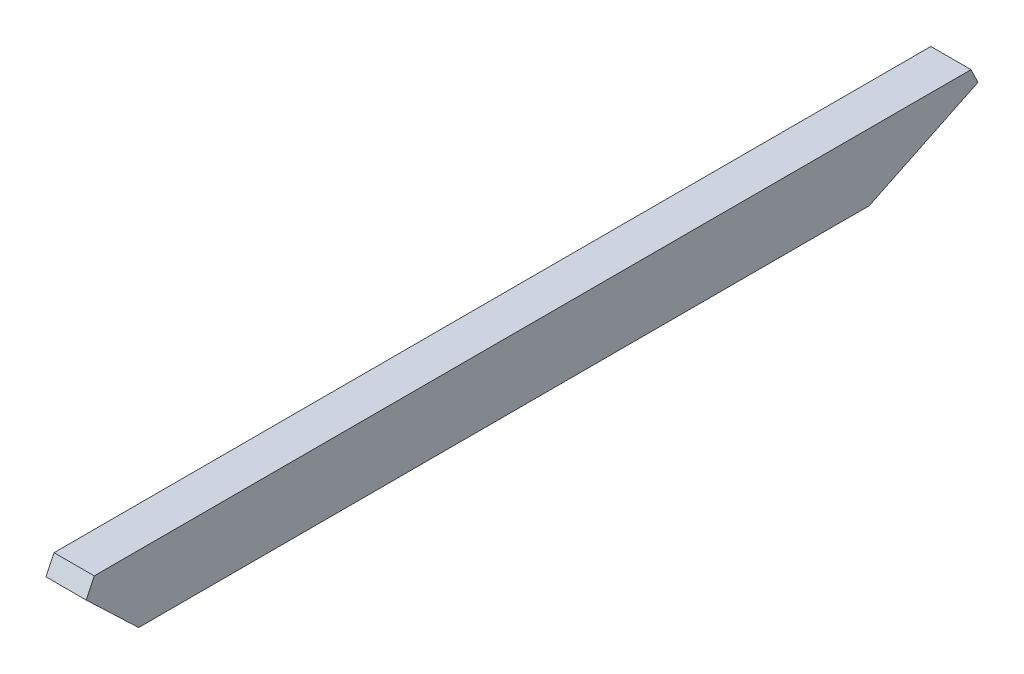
from build123d import *

# Parameters (mm, degrees)
ESQUISSE1_W             = 15
ESQUISSE1_H             = 25
EXTRUSION1_DEPTH        = 333
ENL_V_MAT_EXTRU_1_DEPTH = 335.273839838
ENL_V_MAT_EXTRU_2_DEPTH = 335.273839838
ENL_V_MAT_EXTRU_3_DEPTH = 335.273839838


with BuildPart() as part:
    # Esquisse1 → Extrusion1 (new body)
    with BuildSketch(Plane.XY):
        with Locations((7.5, 12.5)):
            Rectangle(ESQUISSE1_W, ESQUISSE1_H)
    extrude(amount=EXTRUSION1_DEPTH)

    # Esquisse2 → Enl_v. mat.-Extru.1 (cut, through all)
    with BuildSketch(Plane.ZY):
        Polygon((2.607614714, 25), (0, 19.596265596), (-2.470820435, 25), align=None)
    extrude(amount=-ENL_V_MAT_EXTRU_1_DEPTH, mode=Mode.SUBTRACT)

    # Esquisse3 → Enl_v. mat.-Extru.2 (cut, through all)
    with BuildSketch(Plane.ZY):
        Polygon((0, 19.596265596), (40.609149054, 0), (40.609149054, -4.503019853), (-8.446145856, -4.503019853), align=None)
    extrude(amount=-ENL_V_MAT_EXTRU_2_DEPTH, mode=Mode.SUBTRACT)

    # Esquisse4 → Enl_v. mat.-Extru.3 (cut, through all)
    with BuildSketch(Plane.ZY):
        Polygon((329.907614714, 25), (332.907614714, 18.67544468), (313.324490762, 0), (366.259512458, 0), (363.568868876, 25), align=None)
    extrude(amount=-ENL_V_MAT_EXTRU_3_DEPTH, mode=Mode.SUBTRACT)


solid = part.part
